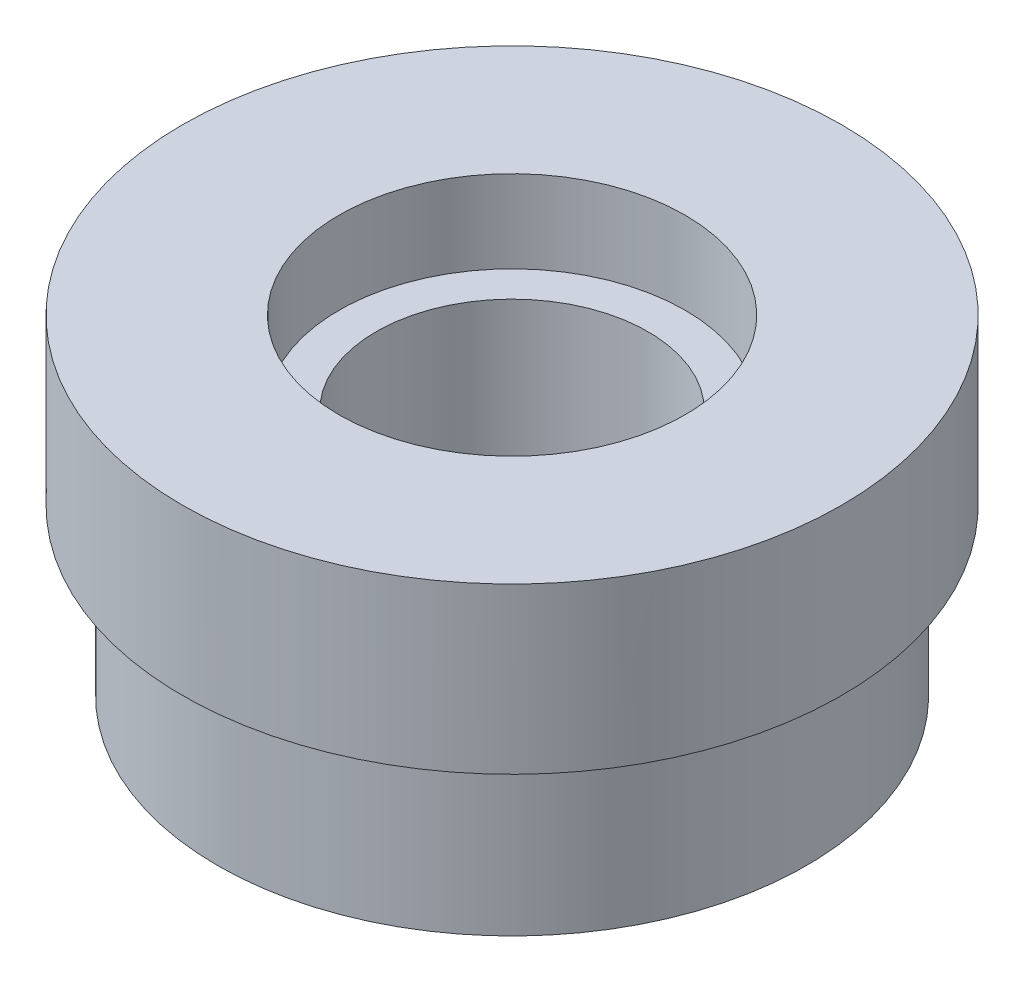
from build123d import *

# Parameters (mm, degrees)
SKETCH1_R         = 40
SKETCH1_R_2       = 16.5
EXTRUDE1_DEPTH    = 40
SKETCH2_R         = 21
EXTRUDE3_DEPTH    = 10
SKETCH7_OUTSIDE_W = 106
SKETCH7_OUTSIDE_H = 106
SKETCH7_OUTSIDE_R = 35.75
EXTRUDE4_DEPTH    = 20


with BuildPart() as part:
    # Sketch1 → Extrude1 (new body)
    with BuildSketch(Plane(origin=(0, 0, 0), x_dir=(1, 0, 0), z_dir=(0, 1, 0))):
        with Locations(Location((0, 0, 0), (0, 0, 270))):
            Circle(SKETCH1_R)
        with Locations(Location((0, 0, 0), (0, 0, 270))):
            Circle(SKETCH1_R_2, mode=Mode.SUBTRACT)
    extrude(amount=EXTRUDE1_DEPTH)

    # Sketch2 → Extrude3 (cut)
    with BuildSketch(Plane(origin=(0, 40, 0), x_dir=(1, 0, 0), z_dir=(0, 1, 0))):
        with Locations(Location((0, 0, 0), (0, 0, 270))):
            Circle(SKETCH2_R)
    extrude(amount=-EXTRUDE3_DEPTH, mode=Mode.SUBTRACT)

    # Sketch7 outside → Extrude4 (cut)
    with BuildSketch(Plane.XZ):
        Rectangle(SKETCH7_OUTSIDE_W, SKETCH7_OUTSIDE_H)
        with Locations(Location((0, 0, 0), (0, 0, 270))):
            Circle(SKETCH7_OUTSIDE_R, mode=Mode.SUBTRACT)
    extrude(amount=-EXTRUDE4_DEPTH, mode=Mode.SUBTRACT)


solid = part.part
